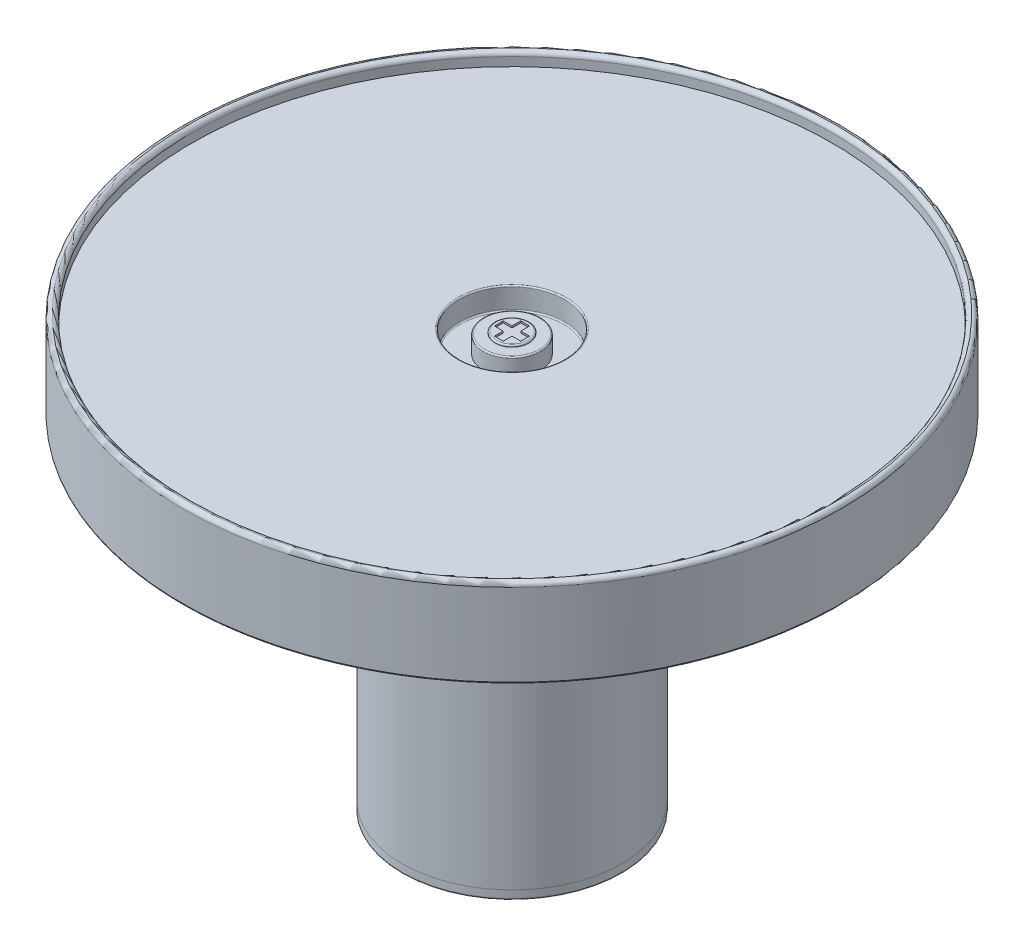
ISO-10303-21;
HEADER;
FILE_DESCRIPTION(('STEP AP214'),'2;1');
FILE_NAME('part.step','',(''),(''),'','','');
FILE_SCHEMA(('AUTOMOTIVE_DESIGN { 1 0 10303 214 1 1 1 1 }'));
ENDSEC;
DATA;
#1=APPLICATION_CONTEXT('core data for automotive mechanical design processes');
#2=APPLICATION_PROTOCOL_DEFINITION('international standard','automotive_design',2000,#1);
#3=PRODUCT_CONTEXT('',#1,'mechanical');
#4=PRODUCT('Part','Part','',(#3));
#5=PRODUCT_RELATED_PRODUCT_CATEGORY('part','',(#4));
#6=PRODUCT_DEFINITION_FORMATION('','',#4);
#7=PRODUCT_DEFINITION_CONTEXT('part definition',#1,'design');
#8=PRODUCT_DEFINITION('design','',#6,#7);
#9=PRODUCT_DEFINITION_SHAPE('','',#8);
#10=(LENGTH_UNIT() NAMED_UNIT(*) SI_UNIT(.MILLI.,.METRE.));
#11=(NAMED_UNIT(*) PLANE_ANGLE_UNIT() SI_UNIT($,.RADIAN.));
#12=(NAMED_UNIT(*) SI_UNIT($,.STERADIAN.) SOLID_ANGLE_UNIT());
#13=UNCERTAINTY_MEASURE_WITH_UNIT(LENGTH_MEASURE(1.E-05),#10,'distance_accuracy_value','');
#14=(GEOMETRIC_REPRESENTATION_CONTEXT(3) GLOBAL_UNCERTAINTY_ASSIGNED_CONTEXT((#13)) GLOBAL_UNIT_ASSIGNED_CONTEXT((#10,
#11,#12)) REPRESENTATION_CONTEXT('',''));
#15=CARTESIAN_POINT('',(0.,0.,0.));
#16=DIRECTION('',(0.,0.,1.));
#17=DIRECTION('',(1.,0.,0.));
#18=AXIS2_PLACEMENT_3D('',#15,#16,#17);
#19=CARTESIAN_POINT('',(0.,94.5,0.));
#20=DIRECTION('',(0.,1.,0.));
#21=DIRECTION('',(0.,0.,1.));
#22=AXIS2_PLACEMENT_3D('',#19,#20,#21);
#23=PLANE('',#22);
#24=CARTESIAN_POINT('',(0.,94.5,0.));
#25=DIRECTION('',(0.,1.,0.));
#26=DIRECTION('',(0.,0.,1.));
#27=AXIS2_PLACEMENT_3D('',#24,#25,#26);
#28=CIRCLE('',#27,3.57639320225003);
#29=CARTESIAN_POINT('',(0.,94.5,3.57639320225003));
#30=VERTEX_POINT('',#29);
#31=EDGE_CURVE('E12',#30,#30,#28,.T.);
#32=ORIENTED_EDGE('',*,*,#31,.T.);
#33=EDGE_LOOP('',(#32));
#34=FACE_BOUND('',#33,.T.);
#35=DIRECTION('',(0.,0.,1.));
#36=VECTOR('',#35,1.);
#37=CARTESIAN_POINT('',(-1.,94.5,-0.999999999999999));
#38=LINE('',#37,#36);
#39=CARTESIAN_POINT('',(-1.,94.5,-3.));
#40=VERTEX_POINT('',#39);
#41=CARTESIAN_POINT('',(-1.,94.5,-0.999999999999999));
#42=VERTEX_POINT('',#41);
#43=EDGE_CURVE('E65',#40,#42,#38,.T.);
#44=ORIENTED_EDGE('',*,*,#43,.F.);
#45=DIRECTION('',(-1.,0.,0.));
#46=VECTOR('',#45,1.);
#47=CARTESIAN_POINT('',(1.,94.5,-3.));
#48=LINE('',#47,#46);
#49=CARTESIAN_POINT('',(1.,94.5,-3.));
#50=VERTEX_POINT('',#49);
#51=EDGE_CURVE('E202',#50,#40,#48,.T.);
#52=ORIENTED_EDGE('',*,*,#51,.F.);
#53=DIRECTION('',(0.,0.,-1.));
#54=VECTOR('',#53,1.);
#55=CARTESIAN_POINT('',(1.,94.5,-0.999999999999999));
#56=LINE('',#55,#54);
#57=CARTESIAN_POINT('',(1.,94.5,-0.999999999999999));
#58=VERTEX_POINT('',#57);
#59=EDGE_CURVE('E200',#58,#50,#56,.T.);
#60=ORIENTED_EDGE('',*,*,#59,.F.);
#61=DIRECTION('',(-1.,0.,0.));
#62=VECTOR('',#61,1.);
#63=CARTESIAN_POINT('',(1.,94.5,-0.999999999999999));
#64=LINE('',#63,#62);
#65=CARTESIAN_POINT('',(3.,94.5,-0.999999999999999));
#66=VERTEX_POINT('',#65);
#67=EDGE_CURVE('E149',#66,#58,#64,.T.);
#68=ORIENTED_EDGE('',*,*,#67,.F.);
#69=DIRECTION('',(0.,0.,-1.));
#70=VECTOR('',#69,1.);
#71=CARTESIAN_POINT('',(3.,94.5,1.));
#72=LINE('',#71,#70);
#73=CARTESIAN_POINT('',(3.,94.5,1.));
#74=VERTEX_POINT('',#73);
#75=EDGE_CURVE('E196',#74,#66,#72,.T.);
#76=ORIENTED_EDGE('',*,*,#75,.F.);
#77=DIRECTION('',(1.,0.,0.));
#78=VECTOR('',#77,1.);
#79=CARTESIAN_POINT('',(1.,94.5,1.));
#80=LINE('',#79,#78);
#81=CARTESIAN_POINT('',(1.,94.5,1.));
#82=VERTEX_POINT('',#81);
#83=EDGE_CURVE('E193',#82,#74,#80,.T.);
#84=ORIENTED_EDGE('',*,*,#83,.F.);
#85=DIRECTION('',(0.,0.,-1.));
#86=VECTOR('',#85,1.);
#87=CARTESIAN_POINT('',(1.,94.5,3.));
#88=LINE('',#87,#86);
#89=CARTESIAN_POINT('',(1.,94.5,3.));
#90=VERTEX_POINT('',#89);
#91=EDGE_CURVE('E190',#90,#82,#88,.T.);
#92=ORIENTED_EDGE('',*,*,#91,.F.);
#93=DIRECTION('',(1.,0.,0.));
#94=VECTOR('',#93,1.);
#95=CARTESIAN_POINT('',(1.,94.5,3.));
#96=LINE('',#95,#94);
#97=CARTESIAN_POINT('',(-1.,94.5,3.));
#98=VERTEX_POINT('',#97);
#99=EDGE_CURVE('E187',#98,#90,#96,.T.);
#100=ORIENTED_EDGE('',*,*,#99,.F.);
#101=DIRECTION('',(0.,0.,1.));
#102=VECTOR('',#101,1.);
#103=CARTESIAN_POINT('',(-1.,94.5,3.));
#104=LINE('',#103,#102);
#105=CARTESIAN_POINT('',(-0.999999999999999,94.5,1.));
#106=VERTEX_POINT('',#105);
#107=EDGE_CURVE('E184',#106,#98,#104,.T.);
#108=ORIENTED_EDGE('',*,*,#107,.F.);
#109=DIRECTION('',(1.,0.,0.));
#110=VECTOR('',#109,1.);
#111=CARTESIAN_POINT('',(-3.,94.5,1.));
#112=LINE('',#111,#110);
#113=CARTESIAN_POINT('',(-3.,94.5,1.));
#114=VERTEX_POINT('',#113);
#115=EDGE_CURVE('E181',#114,#106,#112,.T.);
#116=ORIENTED_EDGE('',*,*,#115,.F.);
#117=DIRECTION('',(0.,0.,1.));
#118=VECTOR('',#117,1.);
#119=CARTESIAN_POINT('',(-3.,94.5,1.));
#120=LINE('',#119,#118);
#121=CARTESIAN_POINT('',(-3.,94.5,-0.999999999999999));
#122=VERTEX_POINT('',#121);
#123=EDGE_CURVE('E178',#122,#114,#120,.T.);
#124=ORIENTED_EDGE('',*,*,#123,.F.);
#125=DIRECTION('',(-1.,0.,0.));
#126=VECTOR('',#125,1.);
#127=CARTESIAN_POINT('',(-3.,94.5,-0.999999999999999));
#128=LINE('',#127,#126);
#129=EDGE_CURVE('E175',#42,#122,#128,.T.);
#130=ORIENTED_EDGE('',*,*,#129,.F.);
#131=EDGE_LOOP('',(#44,#52,#60,#68,#76,#84,#92,#100,#108,#116,#124,#130));
#132=FACE_BOUND('',#131,.T.);
#133=ADVANCED_FACE('F50',(#34,#132),#23,.T.);
#134=CARTESIAN_POINT('',(0.,94.,0.));
#135=DIRECTION('',(0.,1.,0.));
#136=DIRECTION('',(0.,0.,1.));
#137=AXIS2_PLACEMENT_3D('',#134,#135,#136);
#138=PLANE('',#137);
#139=CARTESIAN_POINT('',(0.,94.,0.));
#140=DIRECTION('',(0.,1.,0.));
#141=DIRECTION('',(0.,0.,1.));
#142=AXIS2_PLACEMENT_3D('',#139,#140,#141);
#143=CIRCLE('',#142,3.8);
#144=CARTESIAN_POINT('',(0.,94.,3.8));
#145=VERTEX_POINT('',#144);
#146=EDGE_CURVE('E58',#145,#145,#143,.T.);
#147=ORIENTED_EDGE('',*,*,#146,.F.);
#148=EDGE_LOOP('',(#147));
#149=FACE_BOUND('',#148,.T.);
#150=ADVANCED_FACE('F227',(#149),#138,.F.);
#151=CARTESIAN_POINT('',(-1.,94.1,-0.999999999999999));
#152=DIRECTION('',(-1.,0.,0.));
#153=DIRECTION('',(0.,0.,1.));
#154=AXIS2_PLACEMENT_3D('',#151,#152,#153);
#155=PLANE('',#154);
#156=ORIENTED_EDGE('',*,*,#43,.T.);
#157=DIRECTION('',(0.,1.,0.));
#158=VECTOR('',#157,1.);
#159=CARTESIAN_POINT('',(-1.,94.1,-0.999999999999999));
#160=LINE('',#159,#158);
#161=CARTESIAN_POINT('',(-1.,94.1,-0.999999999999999));
#162=VERTEX_POINT('',#161);
#163=EDGE_CURVE('E113',#162,#42,#160,.T.);
#164=ORIENTED_EDGE('',*,*,#163,.F.);
#165=DIRECTION('',(0.,0.,1.));
#166=VECTOR('',#165,1.);
#167=CARTESIAN_POINT('',(-1.,94.1,-0.999999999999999));
#168=LINE('',#167,#166);
#169=CARTESIAN_POINT('',(-1.,94.1,-3.));
#170=VERTEX_POINT('',#169);
#171=EDGE_CURVE('E204',#170,#162,#168,.T.);
#172=ORIENTED_EDGE('',*,*,#171,.F.);
#173=DIRECTION('',(0.,1.,0.));
#174=VECTOR('',#173,1.);
#175=CARTESIAN_POINT('',(-1.,94.1,-3.));
#176=LINE('',#175,#174);
#177=EDGE_CURVE('E73',#170,#40,#176,.T.);
#178=ORIENTED_EDGE('',*,*,#177,.T.);
#179=EDGE_LOOP('',(#156,#164,#172,#178));
#180=FACE_BOUND('',#179,.T.);
#181=ADVANCED_FACE('F229',(#180),#155,.F.);
#182=CARTESIAN_POINT('',(1.,94.1,-3.));
#183=DIRECTION('',(0.,0.,-1.));
#184=DIRECTION('',(-1.,0.,0.));
#185=AXIS2_PLACEMENT_3D('',#182,#183,#184);
#186=PLANE('',#185);
#187=ORIENTED_EDGE('',*,*,#51,.T.);
#188=ORIENTED_EDGE('',*,*,#177,.F.);
#189=DIRECTION('',(-1.,0.,0.));
#190=VECTOR('',#189,1.);
#191=CARTESIAN_POINT('',(1.,94.1,-3.));
#192=LINE('',#191,#190);
#193=CARTESIAN_POINT('',(1.,94.1,-3.));
#194=VERTEX_POINT('',#193);
#195=EDGE_CURVE('E161',#194,#170,#192,.T.);
#196=ORIENTED_EDGE('',*,*,#195,.F.);
#197=DIRECTION('',(0.,1.,0.));
#198=VECTOR('',#197,1.);
#199=CARTESIAN_POINT('',(1.,94.1,-3.));
#200=LINE('',#199,#198);
#201=EDGE_CURVE('E153',#194,#50,#200,.T.);
#202=ORIENTED_EDGE('',*,*,#201,.T.);
#203=EDGE_LOOP('',(#187,#188,#196,#202));
#204=FACE_BOUND('',#203,.T.);
#205=ADVANCED_FACE('F234',(#204),#186,.F.);
#206=CARTESIAN_POINT('',(1.,94.1,-0.999999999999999));
#207=DIRECTION('',(1.,0.,0.));
#208=DIRECTION('',(0.,0.,-1.));
#209=AXIS2_PLACEMENT_3D('',#206,#207,#208);
#210=PLANE('',#209);
#211=ORIENTED_EDGE('',*,*,#59,.T.);
#212=ORIENTED_EDGE('',*,*,#201,.F.);
#213=DIRECTION('',(0.,0.,-1.));
#214=VECTOR('',#213,1.);
#215=CARTESIAN_POINT('',(1.,94.1,-0.999999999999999));
#216=LINE('',#215,#214);
#217=CARTESIAN_POINT('',(1.,94.1,-0.999999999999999));
#218=VERTEX_POINT('',#217);
#219=EDGE_CURVE('E157',#218,#194,#216,.T.);
#220=ORIENTED_EDGE('',*,*,#219,.F.);
#221=DIRECTION('',(0.,1.,0.));
#222=VECTOR('',#221,1.);
#223=CARTESIAN_POINT('',(1.,94.1,-0.999999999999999));
#224=LINE('',#223,#222);
#225=EDGE_CURVE('E142',#218,#58,#224,.T.);
#226=ORIENTED_EDGE('',*,*,#225,.T.);
#227=EDGE_LOOP('',(#211,#212,#220,#226));
#228=FACE_BOUND('',#227,.T.);
#229=ADVANCED_FACE('F158',(#228),#210,.F.);
#230=CARTESIAN_POINT('',(1.,94.1,-0.999999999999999));
#231=DIRECTION('',(0.,0.,-1.));
#232=DIRECTION('',(-1.,0.,0.));
#233=AXIS2_PLACEMENT_3D('',#230,#231,#232);
#234=PLANE('',#233);
#235=ORIENTED_EDGE('',*,*,#67,.T.);
#236=ORIENTED_EDGE('',*,*,#225,.F.);
#237=DIRECTION('',(-1.,0.,0.));
#238=VECTOR('',#237,1.);
#239=CARTESIAN_POINT('',(1.,94.1,-0.999999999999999));
#240=LINE('',#239,#238);
#241=CARTESIAN_POINT('',(3.,94.1,-0.999999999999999));
#242=VERTEX_POINT('',#241);
#243=EDGE_CURVE('E146',#242,#218,#240,.T.);
#244=ORIENTED_EDGE('',*,*,#243,.F.);
#245=DIRECTION('',(0.,1.,0.));
#246=VECTOR('',#245,1.);
#247=CARTESIAN_POINT('',(3.,94.1,-0.999999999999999));
#248=LINE('',#247,#246);
#249=EDGE_CURVE('E154',#242,#66,#248,.T.);
#250=ORIENTED_EDGE('',*,*,#249,.T.);
#251=EDGE_LOOP('',(#235,#236,#244,#250));
#252=FACE_BOUND('',#251,.T.);
#253=ADVANCED_FACE('F144',(#252),#234,.F.);
#254=CARTESIAN_POINT('',(3.,94.1,1.));
#255=DIRECTION('',(1.,0.,0.));
#256=DIRECTION('',(0.,0.,-1.));
#257=AXIS2_PLACEMENT_3D('',#254,#255,#256);
#258=PLANE('',#257);
#259=ORIENTED_EDGE('',*,*,#75,.T.);
#260=ORIENTED_EDGE('',*,*,#249,.F.);
#261=DIRECTION('',(0.,0.,-1.));
#262=VECTOR('',#261,1.);
#263=CARTESIAN_POINT('',(3.,94.1,1.));
#264=LINE('',#263,#262);
#265=CARTESIAN_POINT('',(3.,94.1,1.));
#266=VERTEX_POINT('',#265);
#267=EDGE_CURVE('E167',#266,#242,#264,.T.);
#268=ORIENTED_EDGE('',*,*,#267,.F.);
#269=DIRECTION('',(0.,1.,0.));
#270=VECTOR('',#269,1.);
#271=CARTESIAN_POINT('',(3.,94.1,1.));
#272=LINE('',#271,#270);
#273=EDGE_CURVE('E208',#266,#74,#272,.T.);
#274=ORIENTED_EDGE('',*,*,#273,.T.);
#275=EDGE_LOOP('',(#259,#260,#268,#274));
#276=FACE_BOUND('',#275,.T.);
#277=ADVANCED_FACE('F266',(#276),#258,.F.);
#278=CARTESIAN_POINT('',(1.,94.1,1.));
#279=DIRECTION('',(0.,0.,1.));
#280=DIRECTION('',(1.,0.,0.));
#281=AXIS2_PLACEMENT_3D('',#278,#279,#280);
#282=PLANE('',#281);
#283=ORIENTED_EDGE('',*,*,#83,.T.);
#284=ORIENTED_EDGE('',*,*,#273,.F.);
#285=DIRECTION('',(1.,0.,0.));
#286=VECTOR('',#285,1.);
#287=CARTESIAN_POINT('',(1.,94.1,1.));
#288=LINE('',#287,#286);
#289=CARTESIAN_POINT('',(1.,94.1,1.));
#290=VERTEX_POINT('',#289);
#291=EDGE_CURVE('E169',#290,#266,#288,.T.);
#292=ORIENTED_EDGE('',*,*,#291,.F.);
#293=DIRECTION('',(0.,1.,0.));
#294=VECTOR('',#293,1.);
#295=CARTESIAN_POINT('',(1.,94.1,1.));
#296=LINE('',#295,#294);
#297=EDGE_CURVE('E210',#290,#82,#296,.T.);
#298=ORIENTED_EDGE('',*,*,#297,.T.);
#299=EDGE_LOOP('',(#283,#284,#292,#298));
#300=FACE_BOUND('',#299,.T.);
#301=ADVANCED_FACE('F262',(#300),#282,.F.);
#302=CARTESIAN_POINT('',(1.,94.1,3.));
#303=DIRECTION('',(1.,0.,0.));
#304=DIRECTION('',(0.,0.,-1.));
#305=AXIS2_PLACEMENT_3D('',#302,#303,#304);
#306=PLANE('',#305);
#307=ORIENTED_EDGE('',*,*,#91,.T.);
#308=ORIENTED_EDGE('',*,*,#297,.F.);
#309=DIRECTION('',(0.,0.,-1.));
#310=VECTOR('',#309,1.);
#311=CARTESIAN_POINT('',(1.,94.1,3.));
#312=LINE('',#311,#310);
#313=CARTESIAN_POINT('',(1.,94.1,3.));
#314=VERTEX_POINT('',#313);
#315=EDGE_CURVE('E396',#314,#290,#312,.T.);
#316=ORIENTED_EDGE('',*,*,#315,.F.);
#317=DIRECTION('',(0.,1.,0.));
#318=VECTOR('',#317,1.);
#319=CARTESIAN_POINT('',(1.,94.1,3.));
#320=LINE('',#319,#318);
#321=EDGE_CURVE('E212',#314,#90,#320,.T.);
#322=ORIENTED_EDGE('',*,*,#321,.T.);
#323=EDGE_LOOP('',(#307,#308,#316,#322));
#324=FACE_BOUND('',#323,.T.);
#325=ADVANCED_FACE('F258',(#324),#306,.F.);
#326=CARTESIAN_POINT('',(1.,94.1,3.));
#327=DIRECTION('',(0.,0.,1.));
#328=DIRECTION('',(1.,0.,0.));
#329=AXIS2_PLACEMENT_3D('',#326,#327,#328);
#330=PLANE('',#329);
#331=ORIENTED_EDGE('',*,*,#99,.T.);
#332=ORIENTED_EDGE('',*,*,#321,.F.);
#333=DIRECTION('',(1.,0.,0.));
#334=VECTOR('',#333,1.);
#335=CARTESIAN_POINT('',(1.,94.1,3.));
#336=LINE('',#335,#334);
#337=CARTESIAN_POINT('',(-1.,94.1,3.));
#338=VERTEX_POINT('',#337);
#339=EDGE_CURVE('E393',#338,#314,#336,.T.);
#340=ORIENTED_EDGE('',*,*,#339,.F.);
#341=DIRECTION('',(0.,1.,0.));
#342=VECTOR('',#341,1.);
#343=CARTESIAN_POINT('',(-1.,94.1,3.));
#344=LINE('',#343,#342);
#345=EDGE_CURVE('E214',#338,#98,#344,.T.);
#346=ORIENTED_EDGE('',*,*,#345,.T.);
#347=EDGE_LOOP('',(#331,#332,#340,#346));
#348=FACE_BOUND('',#347,.T.);
#349=ADVANCED_FACE('F254',(#348),#330,.F.);
#350=CARTESIAN_POINT('',(-1.,94.1,3.));
#351=DIRECTION('',(-1.,0.,0.));
#352=DIRECTION('',(0.,0.,1.));
#353=AXIS2_PLACEMENT_3D('',#350,#351,#352);
#354=PLANE('',#353);
#355=ORIENTED_EDGE('',*,*,#107,.T.);
#356=ORIENTED_EDGE('',*,*,#345,.F.);
#357=DIRECTION('',(0.,0.,1.));
#358=VECTOR('',#357,1.);
#359=CARTESIAN_POINT('',(-1.,94.1,3.));
#360=LINE('',#359,#358);
#361=CARTESIAN_POINT('',(-0.999999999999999,94.1,1.));
#362=VERTEX_POINT('',#361);
#363=EDGE_CURVE('E390',#362,#338,#360,.T.);
#364=ORIENTED_EDGE('',*,*,#363,.F.);
#365=DIRECTION('',(0.,1.,0.));
#366=VECTOR('',#365,1.);
#367=CARTESIAN_POINT('',(-0.999999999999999,94.1,1.));
#368=LINE('',#367,#366);
#369=EDGE_CURVE('E216',#362,#106,#368,.T.);
#370=ORIENTED_EDGE('',*,*,#369,.T.);
#371=EDGE_LOOP('',(#355,#356,#364,#370));
#372=FACE_BOUND('',#371,.T.);
#373=ADVANCED_FACE('F250',(#372),#354,.F.);
#374=CARTESIAN_POINT('',(-3.,94.1,1.));
#375=DIRECTION('',(0.,0.,1.));
#376=DIRECTION('',(1.,0.,0.));
#377=AXIS2_PLACEMENT_3D('',#374,#375,#376);
#378=PLANE('',#377);
#379=ORIENTED_EDGE('',*,*,#115,.T.);
#380=ORIENTED_EDGE('',*,*,#369,.F.);
#381=DIRECTION('',(1.,0.,0.));
#382=VECTOR('',#381,1.);
#383=CARTESIAN_POINT('',(-3.,94.1,1.));
#384=LINE('',#383,#382);
#385=CARTESIAN_POINT('',(-3.,94.1,1.));
#386=VERTEX_POINT('',#385);
#387=EDGE_CURVE('E387',#386,#362,#384,.T.);
#388=ORIENTED_EDGE('',*,*,#387,.F.);
#389=DIRECTION('',(0.,1.,0.));
#390=VECTOR('',#389,1.);
#391=CARTESIAN_POINT('',(-3.,94.1,1.));
#392=LINE('',#391,#390);
#393=EDGE_CURVE('E218',#386,#114,#392,.T.);
#394=ORIENTED_EDGE('',*,*,#393,.T.);
#395=EDGE_LOOP('',(#379,#380,#388,#394));
#396=FACE_BOUND('',#395,.T.);
#397=ADVANCED_FACE('F246',(#396),#378,.F.);
#398=CARTESIAN_POINT('',(-3.,94.1,1.));
#399=DIRECTION('',(-1.,0.,0.));
#400=DIRECTION('',(0.,0.,1.));
#401=AXIS2_PLACEMENT_3D('',#398,#399,#400);
#402=PLANE('',#401);
#403=ORIENTED_EDGE('',*,*,#123,.T.);
#404=ORIENTED_EDGE('',*,*,#393,.F.);
#405=DIRECTION('',(0.,0.,1.));
#406=VECTOR('',#405,1.);
#407=CARTESIAN_POINT('',(-3.,94.1,1.));
#408=LINE('',#407,#406);
#409=CARTESIAN_POINT('',(-3.,94.1,-0.999999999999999));
#410=VERTEX_POINT('',#409);
#411=EDGE_CURVE('E382',#410,#386,#408,.T.);
#412=ORIENTED_EDGE('',*,*,#411,.F.);
#413=DIRECTION('',(0.,1.,0.));
#414=VECTOR('',#413,1.);
#415=CARTESIAN_POINT('',(-3.,94.1,-0.999999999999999));
#416=LINE('',#415,#414);
#417=EDGE_CURVE('E220',#410,#122,#416,.T.);
#418=ORIENTED_EDGE('',*,*,#417,.T.);
#419=EDGE_LOOP('',(#403,#404,#412,#418));
#420=FACE_BOUND('',#419,.T.);
#421=ADVANCED_FACE('F242',(#420),#402,.F.);
#422=CARTESIAN_POINT('',(-3.,94.1,-0.999999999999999));
#423=DIRECTION('',(0.,0.,-1.));
#424=DIRECTION('',(-1.,0.,0.));
#425=AXIS2_PLACEMENT_3D('',#422,#423,#424);
#426=PLANE('',#425);
#427=ORIENTED_EDGE('',*,*,#129,.T.);
#428=ORIENTED_EDGE('',*,*,#417,.F.);
#429=DIRECTION('',(-1.,0.,0.));
#430=VECTOR('',#429,1.);
#431=CARTESIAN_POINT('',(-3.,94.1,-0.999999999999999));
#432=LINE('',#431,#430);
#433=EDGE_CURVE('E380',#162,#410,#432,.T.);
#434=ORIENTED_EDGE('',*,*,#433,.F.);
#435=ORIENTED_EDGE('',*,*,#163,.T.);
#436=EDGE_LOOP('',(#427,#428,#434,#435));
#437=FACE_BOUND('',#436,.T.);
#438=ADVANCED_FACE('F239',(#437),#426,.F.);
#439=CARTESIAN_POINT('',(0.,94.1,0.));
#440=DIRECTION('',(0.,1.,0.));
#441=DIRECTION('',(0.,0.,1.));
#442=AXIS2_PLACEMENT_3D('',#439,#440,#441);
#443=PLANE('',#442);
#444=ORIENTED_EDGE('',*,*,#171,.T.);
#445=ORIENTED_EDGE('',*,*,#433,.T.);
#446=ORIENTED_EDGE('',*,*,#411,.T.);
#447=ORIENTED_EDGE('',*,*,#387,.T.);
#448=ORIENTED_EDGE('',*,*,#363,.T.);
#449=ORIENTED_EDGE('',*,*,#339,.T.);
#450=ORIENTED_EDGE('',*,*,#315,.T.);
#451=ORIENTED_EDGE('',*,*,#291,.T.);
#452=ORIENTED_EDGE('',*,*,#267,.T.);
#453=ORIENTED_EDGE('',*,*,#243,.T.);
#454=ORIENTED_EDGE('',*,*,#219,.T.);
#455=ORIENTED_EDGE('',*,*,#195,.T.);
#456=EDGE_LOOP('',(#444,#445,#446,#447,#448,#449,#450,#451,#452,#453,#454,#455));
#457=FACE_BOUND('',#456,.T.);
#458=ADVANCED_FACE('F164',(#457),#443,.T.);
#459=CARTESIAN_POINT('',(0.,94.2,0.));
#460=DIRECTION('',(0.,-1.,0.));
#461=DIRECTION('',(0.,0.,-1.));
#462=AXIS2_PLACEMENT_3D('',#459,#460,#461);
#463=TOROIDAL_SURFACE('',#462,3.57639320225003,0.3);
#464=ORIENTED_EDGE('',*,*,#146,.T.);
#465=EDGE_LOOP('',(#464));
#466=FACE_BOUND('',#465,.T.);
#467=ORIENTED_EDGE('',*,*,#31,.F.);
#468=EDGE_LOOP('',(#467));
#469=FACE_BOUND('',#468,.T.);
#470=ADVANCED_FACE('F52',(#466,#469),#463,.T.);
#471=CLOSED_SHELL('',(#133,#150,#181,#205,#229,#253,#277,#301,#325,#349,#373,#397,#421,#438,
#458,#470));
#472=MANIFOLD_SOLID_BREP('B2',#471);
#473=CARTESIAN_POINT('',(0.,79.,0.));
#474=DIRECTION('',(0.,-1.,0.));
#475=DIRECTION('',(0.,0.,-1.));
#476=AXIS2_PLACEMENT_3D('',#473,#474,#475);
#477=CYLINDRICAL_SURFACE('',#476,75.);
#478=CARTESIAN_POINT('',(0.,78.3,0.));
#479=DIRECTION('',(0.,-1.,0.));
#480=DIRECTION('',(0.,0.,-1.));
#481=AXIS2_PLACEMENT_3D('',#478,#479,#480);
#482=CIRCLE('',#481,75.);
#483=CARTESIAN_POINT('',(0.,78.3,-75.));
#484=VERTEX_POINT('',#483);
#485=EDGE_CURVE('E442',#484,#484,#482,.F.);
#486=ORIENTED_EDGE('',*,*,#485,.T.);
#487=EDGE_LOOP('',(#486));
#488=FACE_BOUND('',#487,.T.);
#489=CARTESIAN_POINT('',(0.,97.,0.));
#490=DIRECTION('',(0.,1.,0.));
#491=DIRECTION('',(0.,0.,1.));
#492=AXIS2_PLACEMENT_3D('',#489,#490,#491);
#493=CIRCLE('',#492,75.);
#494=CARTESIAN_POINT('',(0.,97.,75.));
#495=VERTEX_POINT('',#494);
#496=EDGE_CURVE('E456',#495,#495,#493,.F.);
#497=ORIENTED_EDGE('',*,*,#496,.T.);
#498=EDGE_LOOP('',(#497));
#499=FACE_BOUND('',#498,.T.);
#500=ADVANCED_FACE('F419',(#488,#499),#477,.T.);
#501=CARTESIAN_POINT('',(0.,78.,0.));
#502=DIRECTION('',(0.,-1.,0.));
#503=DIRECTION('',(0.,0.,-1.));
#504=AXIS2_PLACEMENT_3D('',#501,#502,#503);
#505=PLANE('',#504);
#506=CARTESIAN_POINT('',(0.,78.,0.));
#507=DIRECTION('',(0.,-1.,0.));
#508=DIRECTION('',(0.,0.,-1.));
#509=AXIS2_PLACEMENT_3D('',#506,#507,#508);
#510=CIRCLE('',#509,74.7);
#511=CARTESIAN_POINT('',(0.,78.,-74.7));
#512=VERTEX_POINT('',#511);
#513=EDGE_CURVE('E445',#512,#512,#510,.T.);
#514=ORIENTED_EDGE('',*,*,#513,.T.);
#515=EDGE_LOOP('',(#514));
#516=FACE_BOUND('',#515,.T.);
#517=CARTESIAN_POINT('',(0.,78.,0.));
#518=DIRECTION('',(0.,-1.,0.));
#519=DIRECTION('',(0.,0.,-1.));
#520=AXIS2_PLACEMENT_3D('',#517,#518,#519);
#521=CIRCLE('',#520,71.);
#522=CARTESIAN_POINT('',(0.,78.,-71.));
#523=VERTEX_POINT('',#522);
#524=EDGE_CURVE('E460',#523,#523,#521,.T.);
#525=ORIENTED_EDGE('',*,*,#524,.F.);
#526=EDGE_LOOP('',(#525));
#527=FACE_BOUND('',#526,.T.);
#528=ADVANCED_FACE('F503',(#516,#527),#505,.T.);
#529=CARTESIAN_POINT('',(0.,79.,0.));
#530=DIRECTION('',(0.,-1.,0.));
#531=DIRECTION('',(0.,0.,-1.));
#532=AXIS2_PLACEMENT_3D('',#529,#530,#531);
#533=CYLINDRICAL_SURFACE('',#532,71.);
#534=CARTESIAN_POINT('',(0.,79.,0.));
#535=DIRECTION('',(0.,-1.,0.));
#536=DIRECTION('',(0.,0.,-1.));
#537=AXIS2_PLACEMENT_3D('',#534,#535,#536);
#538=CIRCLE('',#537,71.);
#539=CARTESIAN_POINT('',(0.,79.,-71.));
#540=VERTEX_POINT('',#539);
#541=EDGE_CURVE('E459',#540,#540,#538,.T.);
#542=ORIENTED_EDGE('',*,*,#541,.F.);
#543=EDGE_LOOP('',(#542));
#544=FACE_BOUND('',#543,.T.);
#545=ORIENTED_EDGE('',*,*,#524,.T.);
#546=EDGE_LOOP('',(#545));
#547=FACE_BOUND('',#546,.T.);
#548=ADVANCED_FACE('F509',(#544,#547),#533,.F.);
#549=CARTESIAN_POINT('',(0.,79.,0.));
#550=DIRECTION('',(0.,1.,0.));
#551=DIRECTION('',(0.,0.,1.));
#552=AXIS2_PLACEMENT_3D('',#549,#550,#551);
#553=PLANE('',#552);
#554=ORIENTED_EDGE('',*,*,#541,.T.);
#555=EDGE_LOOP('',(#554));
#556=FACE_BOUND('',#555,.T.);
#557=ADVANCED_FACE('F538',(#556),#553,.F.);
#558=CARTESIAN_POINT('',(0.,95.,0.));
#559=DIRECTION('',(0.,1.,0.));
#560=DIRECTION('',(0.,0.,1.));
#561=AXIS2_PLACEMENT_3D('',#558,#559,#560);
#562=CYLINDRICAL_SURFACE('',#561,73.);
#563=CARTESIAN_POINT('',(0.,97.,0.));
#564=DIRECTION('',(0.,1.,0.));
#565=DIRECTION('',(0.,0.,1.));
#566=AXIS2_PLACEMENT_3D('',#563,#564,#565);
#567=CIRCLE('',#566,73.);
#568=CARTESIAN_POINT('',(0.,97.,73.));
#569=VERTEX_POINT('',#568);
#570=EDGE_CURVE('E448',#569,#569,#567,.T.);
#571=ORIENTED_EDGE('',*,*,#570,.T.);
#572=EDGE_LOOP('',(#571));
#573=FACE_BOUND('',#572,.T.);
#574=CARTESIAN_POINT('',(0.,95.,0.));
#575=DIRECTION('',(0.,1.,0.));
#576=DIRECTION('',(0.,0.,1.));
#577=AXIS2_PLACEMENT_3D('',#574,#575,#576);
#578=CIRCLE('',#577,73.);
#579=CARTESIAN_POINT('',(0.,95.,73.));
#580=VERTEX_POINT('',#579);
#581=EDGE_CURVE('E452',#580,#580,#578,.T.);
#582=ORIENTED_EDGE('',*,*,#581,.F.);
#583=EDGE_LOOP('',(#582));
#584=FACE_BOUND('',#583,.T.);
#585=ADVANCED_FACE('F543',(#573,#584),#562,.F.);
#586=CARTESIAN_POINT('',(0.,95.,0.));
#587=DIRECTION('',(0.,1.,0.));
#588=DIRECTION('',(0.,0.,1.));
#589=AXIS2_PLACEMENT_3D('',#586,#587,#588);
#590=PLANE('',#589);
#591=CARTESIAN_POINT('',(0.,95.,0.));
#592=DIRECTION('',(0.,1.,0.));
#593=DIRECTION('',(0.,0.,1.));
#594=AXIS2_PLACEMENT_3D('',#591,#592,#593);
#595=CIRCLE('',#594,12.3);
#596=CARTESIAN_POINT('',(0.,95.,12.3));
#597=VERTEX_POINT('',#596);
#598=EDGE_CURVE('E426',#597,#597,#595,.F.);
#599=ORIENTED_EDGE('',*,*,#598,.T.);
#600=EDGE_LOOP('',(#599));
#601=FACE_BOUND('',#600,.T.);
#602=ORIENTED_EDGE('',*,*,#581,.T.);
#603=EDGE_LOOP('',(#602));
#604=FACE_BOUND('',#603,.T.);
#605=ADVANCED_FACE('F522',(#601,#604),#590,.T.);
#606=CARTESIAN_POINT('',(0.,97.,0.));
#607=DIRECTION('',(0.,1.,0.));
#608=DIRECTION('',(0.,0.,1.));
#609=AXIS2_PLACEMENT_3D('',#606,#607,#608);
#610=TOROIDAL_SURFACE('',#609,74.,1.);
#611=ORIENTED_EDGE('',*,*,#570,.F.);
#612=EDGE_LOOP('',(#611));
#613=FACE_BOUND('',#612,.T.);
#614=CARTESIAN_POINT('',(0.,98.,0.));
#615=DIRECTION('',(0.,1.,0.));
#616=DIRECTION('',(0.,0.,1.));
#617=AXIS2_PLACEMENT_3D('',#614,#615,#616);
#618=CIRCLE('',#617,74.);
#619=CARTESIAN_POINT('',(0.,98.,74.));
#620=VERTEX_POINT('',#619);
#621=EDGE_CURVE('E449',#620,#620,#618,.F.);
#622=ORIENTED_EDGE('',*,*,#621,.F.);
#623=EDGE_LOOP('',(#622));
#624=FACE_BOUND('',#623,.T.);
#625=ADVANCED_FACE('F519',(#613,#624),#610,.T.);
#626=CARTESIAN_POINT('',(0.,97.,0.));
#627=DIRECTION('',(0.,1.,0.));
#628=DIRECTION('',(0.,0.,1.));
#629=AXIS2_PLACEMENT_3D('',#626,#627,#628);
#630=TOROIDAL_SURFACE('',#629,74.,1.);
#631=ORIENTED_EDGE('',*,*,#496,.F.);
#632=EDGE_LOOP('',(#631));
#633=FACE_BOUND('',#632,.T.);
#634=ORIENTED_EDGE('',*,*,#621,.T.);
#635=EDGE_LOOP('',(#634));
#636=FACE_BOUND('',#635,.T.);
#637=ADVANCED_FACE('F515',(#633,#636),#630,.T.);
#638=CARTESIAN_POINT('',(0.,78.3,0.));
#639=DIRECTION('',(0.,-1.,0.));
#640=DIRECTION('',(0.,0.,-1.));
#641=AXIS2_PLACEMENT_3D('',#638,#639,#640);
#642=TOROIDAL_SURFACE('',#641,74.7,0.3);
#643=ORIENTED_EDGE('',*,*,#485,.F.);
#644=EDGE_LOOP('',(#643));
#645=FACE_BOUND('',#644,.T.);
#646=ORIENTED_EDGE('',*,*,#513,.F.);
#647=EDGE_LOOP('',(#646));
#648=FACE_BOUND('',#647,.T.);
#649=ADVANCED_FACE('F518',(#645,#648),#642,.T.);
#650=CARTESIAN_POINT('',(0.,90.,0.));
#651=DIRECTION('',(0.,1.,0.));
#652=DIRECTION('',(0.,0.,1.));
#653=AXIS2_PLACEMENT_3D('',#650,#651,#652);
#654=CYLINDRICAL_SURFACE('',#653,12.);
#655=CARTESIAN_POINT('',(0.,90.3,0.));
#656=DIRECTION('',(0.,1.,0.));
#657=DIRECTION('',(0.,0.,1.));
#658=AXIS2_PLACEMENT_3D('',#655,#656,#657);
#659=CIRCLE('',#658,12.);
#660=CARTESIAN_POINT('',(0.,90.3,12.));
#661=VERTEX_POINT('',#660);
#662=EDGE_CURVE('E430',#661,#661,#659,.F.);
#663=ORIENTED_EDGE('',*,*,#662,.T.);
#664=EDGE_LOOP('',(#663));
#665=FACE_BOUND('',#664,.T.);
#666=CARTESIAN_POINT('',(0.,94.7,0.));
#667=DIRECTION('',(0.,1.,0.));
#668=DIRECTION('',(0.,0.,1.));
#669=AXIS2_PLACEMENT_3D('',#666,#667,#668);
#670=CIRCLE('',#669,12.);
#671=CARTESIAN_POINT('',(0.,94.7,12.));
#672=VERTEX_POINT('',#671);
#673=EDGE_CURVE('E434',#672,#672,#670,.T.);
#674=ORIENTED_EDGE('',*,*,#673,.T.);
#675=EDGE_LOOP('',(#674));
#676=FACE_BOUND('',#675,.T.);
#677=ADVANCED_FACE('F488',(#665,#676),#654,.F.);
#678=CARTESIAN_POINT('',(0.,90.,0.));
#679=DIRECTION('',(0.,1.,0.));
#680=DIRECTION('',(0.,0.,1.));
#681=AXIS2_PLACEMENT_3D('',#678,#679,#680);
#682=PLANE('',#681);
#683=CARTESIAN_POINT('',(0.,90.,0.));
#684=DIRECTION('',(0.,1.,0.));
#685=DIRECTION('',(0.,0.,1.));
#686=AXIS2_PLACEMENT_3D('',#683,#684,#685);
#687=CIRCLE('',#686,6.5);
#688=CARTESIAN_POINT('',(0.,90.,6.5));
#689=VERTEX_POINT('',#688);
#690=EDGE_CURVE('E478',#689,#689,#687,.T.);
#691=ORIENTED_EDGE('',*,*,#690,.F.);
#692=EDGE_LOOP('',(#691));
#693=FACE_BOUND('',#692,.T.);
#694=CARTESIAN_POINT('',(0.,90.,0.));
#695=DIRECTION('',(0.,1.,0.));
#696=DIRECTION('',(0.,0.,1.));
#697=AXIS2_PLACEMENT_3D('',#694,#695,#696);
#698=CIRCLE('',#697,11.7);
#699=CARTESIAN_POINT('',(0.,90.,11.7));
#700=VERTEX_POINT('',#699);
#701=EDGE_CURVE('E439',#700,#700,#698,.T.);
#702=ORIENTED_EDGE('',*,*,#701,.T.);
#703=EDGE_LOOP('',(#702));
#704=FACE_BOUND('',#703,.T.);
#705=ADVANCED_FACE('F484',(#693,#704),#682,.T.);
#706=CARTESIAN_POINT('',(0.,90.3,0.));
#707=DIRECTION('',(0.,1.,0.));
#708=DIRECTION('',(0.,0.,1.));
#709=AXIS2_PLACEMENT_3D('',#706,#707,#708);
#710=TOROIDAL_SURFACE('',#709,11.7,0.3);
#711=ORIENTED_EDGE('',*,*,#662,.F.);
#712=EDGE_LOOP('',(#711));
#713=FACE_BOUND('',#712,.T.);
#714=ORIENTED_EDGE('',*,*,#701,.F.);
#715=EDGE_LOOP('',(#714));
#716=FACE_BOUND('',#715,.T.);
#717=ADVANCED_FACE('F487',(#713,#716),#710,.F.);
#718=CARTESIAN_POINT('',(0.,94.7,0.));
#719=DIRECTION('',(0.,1.,0.));
#720=DIRECTION('',(0.,0.,1.));
#721=AXIS2_PLACEMENT_3D('',#718,#719,#720);
#722=TOROIDAL_SURFACE('',#721,12.3,0.3);
#723=ORIENTED_EDGE('',*,*,#598,.F.);
#724=EDGE_LOOP('',(#723));
#725=FACE_BOUND('',#724,.T.);
#726=ORIENTED_EDGE('',*,*,#673,.F.);
#727=EDGE_LOOP('',(#726));
#728=FACE_BOUND('',#727,.T.);
#729=ADVANCED_FACE('F421',(#725,#728),#722,.T.);
#730=CARTESIAN_POINT('',(0.,94.,0.));
#731=DIRECTION('',(0.,1.,0.));
#732=DIRECTION('',(0.,0.,1.));
#733=AXIS2_PLACEMENT_3D('',#730,#731,#732);
#734=PLANE('',#733);
#735=CARTESIAN_POINT('',(0.,94.,0.));
#736=DIRECTION('',(0.,1.,0.));
#737=DIRECTION('',(0.,0.,1.));
#738=AXIS2_PLACEMENT_3D('',#735,#736,#737);
#739=CIRCLE('',#738,6.2);
#740=CARTESIAN_POINT('',(0.,94.,6.2));
#741=VERTEX_POINT('',#740);
#742=EDGE_CURVE('E472',#741,#741,#739,.T.);
#743=ORIENTED_EDGE('',*,*,#742,.T.);
#744=EDGE_LOOP('',(#743));
#745=FACE_BOUND('',#744,.T.);
#746=CARTESIAN_POINT('',(0.,94.,0.));
#747=DIRECTION('',(0.,1.,0.));
#748=DIRECTION('',(0.,0.,1.));
#749=AXIS2_PLACEMENT_3D('',#746,#747,#748);
#750=CIRCLE('',#749,3.8);
#751=CARTESIAN_POINT('',(0.,94.,3.8));
#752=VERTEX_POINT('',#751);
#753=EDGE_CURVE('E475',#752,#752,#750,.F.);
#754=ORIENTED_EDGE('',*,*,#753,.T.);
#755=EDGE_LOOP('',(#754));
#756=FACE_BOUND('',#755,.T.);
#757=ADVANCED_FACE('F498',(#745,#756),#734,.T.);
#758=CARTESIAN_POINT('',(0.,94.,0.));
#759=DIRECTION('',(0.,-1.,0.));
#760=DIRECTION('',(0.,0.,-1.));
#761=AXIS2_PLACEMENT_3D('',#758,#759,#760);
#762=CYLINDRICAL_SURFACE('',#761,6.5);
#763=CARTESIAN_POINT('',(0.,93.7,0.));
#764=DIRECTION('',(0.,1.,0.));
#765=DIRECTION('',(0.,0.,1.));
#766=AXIS2_PLACEMENT_3D('',#763,#764,#765);
#767=CIRCLE('',#766,6.5);
#768=CARTESIAN_POINT('',(0.,93.7,6.5));
#769=VERTEX_POINT('',#768);
#770=EDGE_CURVE('E469',#769,#769,#767,.F.);
#771=ORIENTED_EDGE('',*,*,#770,.T.);
#772=EDGE_LOOP('',(#771));
#773=FACE_BOUND('',#772,.T.);
#774=ORIENTED_EDGE('',*,*,#690,.T.);
#775=EDGE_LOOP('',(#774));
#776=FACE_BOUND('',#775,.T.);
#777=ADVANCED_FACE('F482',(#773,#776),#762,.T.);
#778=CARTESIAN_POINT('',(0.,94.,0.));
#779=DIRECTION('',(0.,-1.,0.));
#780=DIRECTION('',(0.,0.,-1.));
#781=AXIS2_PLACEMENT_3D('',#778,#779,#780);
#782=CYLINDRICAL_SURFACE('',#781,3.5);
#783=CARTESIAN_POINT('',(0.,93.7,0.));
#784=DIRECTION('',(0.,1.,0.));
#785=DIRECTION('',(0.,0.,1.));
#786=AXIS2_PLACEMENT_3D('',#783,#784,#785);
#787=CIRCLE('',#786,3.5);
#788=CARTESIAN_POINT('',(0.,93.7,3.5));
#789=VERTEX_POINT('',#788);
#790=EDGE_CURVE('E453',#789,#789,#787,.T.);
#791=ORIENTED_EDGE('',*,*,#790,.T.);
#792=EDGE_LOOP('',(#791));
#793=FACE_BOUND('',#792,.T.);
#794=CARTESIAN_POINT('',(0.,90.,0.));
#795=DIRECTION('',(0.,1.,0.));
#796=DIRECTION('',(0.,0.,1.));
#797=AXIS2_PLACEMENT_3D('',#794,#795,#796);
#798=CIRCLE('',#797,3.5);
#799=CARTESIAN_POINT('',(0.,90.,3.5));
#800=VERTEX_POINT('',#799);
#801=EDGE_CURVE('E49',#800,#800,#798,.F.);
#802=ORIENTED_EDGE('',*,*,#801,.T.);
#803=EDGE_LOOP('',(#802));
#804=FACE_BOUND('',#803,.T.);
#805=ADVANCED_FACE('F560',(#793,#804),#782,.F.);
#806=CARTESIAN_POINT('',(0.,93.7,0.));
#807=DIRECTION('',(0.,1.,0.));
#808=DIRECTION('',(0.,0.,1.));
#809=AXIS2_PLACEMENT_3D('',#806,#807,#808);
#810=TOROIDAL_SURFACE('',#809,6.2,0.3);
#811=ORIENTED_EDGE('',*,*,#770,.F.);
#812=EDGE_LOOP('',(#811));
#813=FACE_BOUND('',#812,.T.);
#814=ORIENTED_EDGE('',*,*,#742,.F.);
#815=EDGE_LOOP('',(#814));
#816=FACE_BOUND('',#815,.T.);
#817=ADVANCED_FACE('F556',(#813,#816),#810,.T.);
#818=CARTESIAN_POINT('',(0.,93.7,0.));
#819=DIRECTION('',(0.,1.,0.));
#820=DIRECTION('',(0.,0.,1.));
#821=AXIS2_PLACEMENT_3D('',#818,#819,#820);
#822=TOROIDAL_SURFACE('',#821,3.8,0.3);
#823=ORIENTED_EDGE('',*,*,#753,.F.);
#824=EDGE_LOOP('',(#823));
#825=FACE_BOUND('',#824,.T.);
#826=ORIENTED_EDGE('',*,*,#790,.F.);
#827=EDGE_LOOP('',(#826));
#828=FACE_BOUND('',#827,.T.);
#829=ADVANCED_FACE('F553',(#825,#828),#822,.T.);
#830=ORIENTED_EDGE('',*,*,#801,.F.);
#831=EDGE_LOOP('',(#830));
#832=FACE_BOUND('',#831,.T.);
#833=ADVANCED_FACE('F490',(#832),#682,.T.);
#834=CLOSED_SHELL('',(#500,#528,#548,#557,#585,#605,#625,#637,#649,#677,#705,#717,#729,#757,
#777,#805,#817,#829,#833));
#835=MANIFOLD_SOLID_BREP('B6',#834);
#836=CARTESIAN_POINT('',(0.,79.,0.));
#837=DIRECTION('',(0.,-1.,0.));
#838=DIRECTION('',(0.,0.,-1.));
#839=AXIS2_PLACEMENT_3D('',#836,#837,#838);
#840=CYLINDRICAL_SURFACE('',#839,71.);
#841=CARTESIAN_POINT('',(0.,79.,0.));
#842=DIRECTION('',(0.,1.,0.));
#843=DIRECTION('',(0.,0.,1.));
#844=AXIS2_PLACEMENT_3D('',#841,#842,#843);
#845=CIRCLE('',#844,71.);
#846=CARTESIAN_POINT('',(0.,79.,71.));
#847=VERTEX_POINT('',#846);
#848=EDGE_CURVE('E418',#847,#847,#845,.T.);
#849=ORIENTED_EDGE('',*,*,#848,.F.);
#850=EDGE_LOOP('',(#849));
#851=FACE_BOUND('',#850,.T.);
#852=CARTESIAN_POINT('',(0.,78.,0.));
#853=DIRECTION('',(0.,1.,0.));
#854=DIRECTION('',(0.,0.,1.));
#855=AXIS2_PLACEMENT_3D('',#852,#853,#854);
#856=CIRCLE('',#855,71.);
#857=CARTESIAN_POINT('',(0.,78.,71.));
#858=VERTEX_POINT('',#857);
#859=EDGE_CURVE('E712',#858,#858,#856,.T.);
#860=ORIENTED_EDGE('',*,*,#859,.T.);
#861=EDGE_LOOP('',(#860));
#862=FACE_BOUND('',#861,.T.);
#863=ADVANCED_FACE('F709',(#851,#862),#840,.T.);
#864=CARTESIAN_POINT('',(0.,79.,0.));
#865=DIRECTION('',(0.,1.,0.));
#866=DIRECTION('',(0.,0.,1.));
#867=AXIS2_PLACEMENT_3D('',#864,#865,#866);
#868=PLANE('',#867);
#869=ORIENTED_EDGE('',*,*,#848,.T.);
#870=EDGE_LOOP('',(#869));
#871=FACE_BOUND('',#870,.T.);
#872=ADVANCED_FACE('F724',(#871),#868,.T.);
#873=CARTESIAN_POINT('',(0.,78.,0.));
#874=DIRECTION('',(0.,1.,0.));
#875=DIRECTION('',(0.,0.,1.));
#876=AXIS2_PLACEMENT_3D('',#873,#874,#875);
#877=PLANE('',#876);
#878=ORIENTED_EDGE('',*,*,#859,.F.);
#879=EDGE_LOOP('',(#878));
#880=FACE_BOUND('',#879,.T.);
#881=ADVANCED_FACE('F722',(#880),#877,.F.);
#882=CLOSED_SHELL('',(#863,#872,#881));
#883=MANIFOLD_SOLID_BREP('B44',#882);
#884=CARTESIAN_POINT('',(0.,78.,0.));
#885=DIRECTION('',(0.,1.,0.));
#886=DIRECTION('',(0.,0.,1.));
#887=AXIS2_PLACEMENT_3D('',#884,#885,#886);
#888=PLANE('',#887);
#889=CARTESIAN_POINT('',(0.,78.,0.));
#890=DIRECTION('',(0.,1.,0.));
#891=DIRECTION('',(0.,0.,1.));
#892=AXIS2_PLACEMENT_3D('',#889,#890,#891);
#893=CIRCLE('',#892,25.);
#894=CARTESIAN_POINT('',(0.,78.,25.));
#895=VERTEX_POINT('',#894);
#896=EDGE_CURVE('E708',#895,#895,#893,.T.);
#897=ORIENTED_EDGE('',*,*,#896,.T.);
#898=EDGE_LOOP('',(#897));
#899=FACE_BOUND('',#898,.T.);
#900=CARTESIAN_POINT('',(0.,78.,0.));
#901=DIRECTION('',(0.,1.,0.));
#902=DIRECTION('',(0.,0.,1.));
#903=AXIS2_PLACEMENT_3D('',#900,#901,#902);
#904=CIRCLE('',#903,23.);
#905=CARTESIAN_POINT('',(0.,78.,23.));
#906=VERTEX_POINT('',#905);
#907=EDGE_CURVE('E768',#906,#906,#904,.T.);
#908=ORIENTED_EDGE('',*,*,#907,.F.);
#909=EDGE_LOOP('',(#908));
#910=FACE_BOUND('',#909,.T.);
#911=ADVANCED_FACE('F757',(#899,#910),#888,.T.);
#912=CARTESIAN_POINT('',(0.,77.,0.));
#913=DIRECTION('',(0.,1.,0.));
#914=DIRECTION('',(0.,0.,1.));
#915=AXIS2_PLACEMENT_3D('',#912,#913,#914);
#916=PLANE('',#915);
#917=CARTESIAN_POINT('',(0.,77.,0.));
#918=DIRECTION('',(0.,1.,0.));
#919=DIRECTION('',(0.,0.,1.));
#920=AXIS2_PLACEMENT_3D('',#917,#918,#919);
#921=CIRCLE('',#920,25.);
#922=CARTESIAN_POINT('',(0.,77.,25.));
#923=VERTEX_POINT('',#922);
#924=EDGE_CURVE('E761',#923,#923,#921,.T.);
#925=ORIENTED_EDGE('',*,*,#924,.F.);
#926=EDGE_LOOP('',(#925));
#927=FACE_BOUND('',#926,.T.);
#928=CARTESIAN_POINT('',(0.,77.,0.));
#929=DIRECTION('',(0.,1.,0.));
#930=DIRECTION('',(0.,0.,1.));
#931=AXIS2_PLACEMENT_3D('',#928,#929,#930);
#932=CIRCLE('',#931,23.);
#933=CARTESIAN_POINT('',(0.,77.,23.));
#934=VERTEX_POINT('',#933);
#935=EDGE_CURVE('E770',#934,#934,#932,.T.);
#936=ORIENTED_EDGE('',*,*,#935,.T.);
#937=EDGE_LOOP('',(#936));
#938=FACE_BOUND('',#937,.T.);
#939=ADVANCED_FACE('F780',(#927,#938),#916,.F.);
#940=CARTESIAN_POINT('',(0.,78.,0.));
#941=DIRECTION('',(0.,-1.,0.));
#942=DIRECTION('',(0.,0.,-1.));
#943=AXIS2_PLACEMENT_3D('',#940,#941,#942);
#944=CYLINDRICAL_SURFACE('',#943,25.);
#945=ORIENTED_EDGE('',*,*,#896,.F.);
#946=EDGE_LOOP('',(#945));
#947=FACE_BOUND('',#946,.T.);
#948=ORIENTED_EDGE('',*,*,#924,.T.);
#949=EDGE_LOOP('',(#948));
#950=FACE_BOUND('',#949,.T.);
#951=ADVANCED_FACE('F759',(#947,#950),#944,.T.);
#952=CARTESIAN_POINT('',(0.,78.,0.));
#953=DIRECTION('',(0.,-1.,0.));
#954=DIRECTION('',(0.,0.,-1.));
#955=AXIS2_PLACEMENT_3D('',#952,#953,#954);
#956=CYLINDRICAL_SURFACE('',#955,23.);
#957=ORIENTED_EDGE('',*,*,#907,.T.);
#958=EDGE_LOOP('',(#957));
#959=FACE_BOUND('',#958,.T.);
#960=ORIENTED_EDGE('',*,*,#935,.F.);
#961=EDGE_LOOP('',(#960));
#962=FACE_BOUND('',#961,.T.);
#963=ADVANCED_FACE('F776',(#959,#962),#956,.F.);
#964=CLOSED_SHELL('',(#911,#939,#951,#963));
#965=MANIFOLD_SOLID_BREP('B413',#964);
#966=CARTESIAN_POINT('',(0.,77.,0.));
#967=DIRECTION('',(0.,1.,0.));
#968=DIRECTION('',(0.,0.,1.));
#969=AXIS2_PLACEMENT_3D('',#966,#967,#968);
#970=PLANE('',#969);
#971=CARTESIAN_POINT('',(0.,77.,0.));
#972=DIRECTION('',(0.,1.,0.));
#973=DIRECTION('',(0.,0.,1.));
#974=AXIS2_PLACEMENT_3D('',#971,#972,#973);
#975=CIRCLE('',#974,25.);
#976=CARTESIAN_POINT('',(0.,77.,25.));
#977=VERTEX_POINT('',#976);
#978=EDGE_CURVE('E756',#977,#977,#975,.T.);
#979=ORIENTED_EDGE('',*,*,#978,.T.);
#980=EDGE_LOOP('',(#979));
#981=FACE_BOUND('',#980,.T.);
#982=CARTESIAN_POINT('',(0.,77.,0.));
#983=DIRECTION('',(0.,1.,0.));
#984=DIRECTION('',(0.,0.,1.));
#985=AXIS2_PLACEMENT_3D('',#982,#983,#984);
#986=CIRCLE('',#985,23.);
#987=CARTESIAN_POINT('',(0.,77.,23.));
#988=VERTEX_POINT('',#987);
#989=EDGE_CURVE('E836',#988,#988,#986,.T.);
#990=ORIENTED_EDGE('',*,*,#989,.F.);
#991=EDGE_LOOP('',(#990));
#992=FACE_BOUND('',#991,.T.);
#993=ADVANCED_FACE('F825',(#981,#992),#970,.T.);
#994=CARTESIAN_POINT('',(0.,2.,0.));
#995=DIRECTION('',(0.,1.,0.));
#996=DIRECTION('',(0.,0.,1.));
#997=AXIS2_PLACEMENT_3D('',#994,#995,#996);
#998=PLANE('',#997);
#999=CARTESIAN_POINT('',(0.,2.,0.));
#1000=DIRECTION('',(0.,1.,0.));
#1001=DIRECTION('',(0.,0.,1.));
#1002=AXIS2_PLACEMENT_3D('',#999,#1000,#1001);
#1003=CIRCLE('',#1002,25.);
#1004=CARTESIAN_POINT('',(0.,2.,25.));
#1005=VERTEX_POINT('',#1004);
#1006=EDGE_CURVE('E829',#1005,#1005,#1003,.T.);
#1007=ORIENTED_EDGE('',*,*,#1006,.F.);
#1008=EDGE_LOOP('',(#1007));
#1009=FACE_BOUND('',#1008,.T.);
#1010=CARTESIAN_POINT('',(0.,2.,0.));
#1011=DIRECTION('',(0.,1.,0.));
#1012=DIRECTION('',(0.,0.,1.));
#1013=AXIS2_PLACEMENT_3D('',#1010,#1011,#1012);
#1014=CIRCLE('',#1013,23.);
#1015=CARTESIAN_POINT('',(0.,2.,23.));
#1016=VERTEX_POINT('',#1015);
#1017=EDGE_CURVE('E838',#1016,#1016,#1014,.T.);
#1018=ORIENTED_EDGE('',*,*,#1017,.T.);
#1019=EDGE_LOOP('',(#1018));
#1020=FACE_BOUND('',#1019,.T.);
#1021=ADVANCED_FACE('F848',(#1009,#1020),#998,.F.);
#1022=CARTESIAN_POINT('',(0.,77.,0.));
#1023=DIRECTION('',(0.,-1.,0.));
#1024=DIRECTION('',(0.,0.,-1.));
#1025=AXIS2_PLACEMENT_3D('',#1022,#1023,#1024);
#1026=CYLINDRICAL_SURFACE('',#1025,25.);
#1027=ORIENTED_EDGE('',*,*,#978,.F.);
#1028=EDGE_LOOP('',(#1027));
#1029=FACE_BOUND('',#1028,.T.);
#1030=ORIENTED_EDGE('',*,*,#1006,.T.);
#1031=EDGE_LOOP('',(#1030));
#1032=FACE_BOUND('',#1031,.T.);
#1033=ADVANCED_FACE('F827',(#1029,#1032),#1026,.T.);
#1034=CARTESIAN_POINT('',(0.,77.,0.));
#1035=DIRECTION('',(0.,-1.,0.));
#1036=DIRECTION('',(0.,0.,-1.));
#1037=AXIS2_PLACEMENT_3D('',#1034,#1035,#1036);
#1038=CYLINDRICAL_SURFACE('',#1037,23.);
#1039=ORIENTED_EDGE('',*,*,#989,.T.);
#1040=EDGE_LOOP('',(#1039));
#1041=FACE_BOUND('',#1040,.T.);
#1042=ORIENTED_EDGE('',*,*,#1017,.F.);
#1043=EDGE_LOOP('',(#1042));
#1044=FACE_BOUND('',#1043,.T.);
#1045=ADVANCED_FACE('F844',(#1041,#1044),#1038,.F.);
#1046=CLOSED_SHELL('',(#993,#1021,#1033,#1045));
#1047=MANIFOLD_SOLID_BREP('B703',#1046);
#1048=CARTESIAN_POINT('',(0.,13.,0.));
#1049=DIRECTION('',(0.,-1.,0.));
#1050=DIRECTION('',(0.,0.,-1.));
#1051=AXIS2_PLACEMENT_3D('',#1048,#1049,#1050);
#1052=CYLINDRICAL_SURFACE('',#1051,20.5);
#1053=CARTESIAN_POINT('',(0.,7.,0.));
#1054=DIRECTION('',(0.,1.,0.));
#1055=DIRECTION('',(0.,0.,1.));
#1056=AXIS2_PLACEMENT_3D('',#1053,#1054,#1055);
#1057=CIRCLE('',#1056,20.5);
#1058=CARTESIAN_POINT('',(0.,7.,20.5));
#1059=VERTEX_POINT('',#1058);
#1060=EDGE_CURVE('E941',#1059,#1059,#1057,.T.);
#1061=ORIENTED_EDGE('',*,*,#1060,.T.);
#1062=EDGE_LOOP('',(#1061));
#1063=FACE_BOUND('',#1062,.T.);
#1064=CARTESIAN_POINT('',(0.,8.95278640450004,0.));
#1065=DIRECTION('',(0.,-1.,0.));
#1066=DIRECTION('',(0.,0.,-1.));
#1067=AXIS2_PLACEMENT_3D('',#1064,#1065,#1066);
#1068=CIRCLE('',#1067,20.5);
#1069=CARTESIAN_POINT('',(0.,8.95278640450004,-20.5));
#1070=VERTEX_POINT('',#1069);
#1071=EDGE_CURVE('E918',#1070,#1070,#1068,.F.);
#1072=ORIENTED_EDGE('',*,*,#1071,.F.);
#1073=EDGE_LOOP('',(#1072));
#1074=FACE_BOUND('',#1073,.T.);
#1075=ADVANCED_FACE('F886',(#1063,#1074),#1052,.T.);
#1076=CARTESIAN_POINT('',(0.,7.,0.));
#1077=DIRECTION('',(0.,1.,0.));
#1078=DIRECTION('',(0.,0.,1.));
#1079=AXIS2_PLACEMENT_3D('',#1076,#1077,#1078);
#1080=PLANE('',#1079);
#1081=CARTESIAN_POINT('',(0.,7.,0.));
#1082=DIRECTION('',(0.,1.,0.));
#1083=DIRECTION('',(0.,0.,1.));
#1084=AXIS2_PLACEMENT_3D('',#1081,#1082,#1083);
#1085=CIRCLE('',#1084,22.5);
#1086=CARTESIAN_POINT('',(0.,7.,22.5));
#1087=VERTEX_POINT('',#1086);
#1088=EDGE_CURVE('E937',#1087,#1087,#1085,.T.);
#1089=ORIENTED_EDGE('',*,*,#1088,.T.);
#1090=EDGE_LOOP('',(#1089));
#1091=FACE_BOUND('',#1090,.T.);
#1092=ORIENTED_EDGE('',*,*,#1060,.F.);
#1093=EDGE_LOOP('',(#1092));
#1094=FACE_BOUND('',#1093,.T.);
#1095=ADVANCED_FACE('F979',(#1091,#1094),#1080,.T.);
#1096=CARTESIAN_POINT('',(0.,2.,0.));
#1097=DIRECTION('',(0.,-1.,0.));
#1098=DIRECTION('',(0.,0.,-1.));
#1099=AXIS2_PLACEMENT_3D('',#1096,#1097,#1098);
#1100=CYLINDRICAL_SURFACE('',#1099,25.);
#1101=CARTESIAN_POINT('',(0.,0.3,0.));
#1102=DIRECTION('',(0.,1.,0.));
#1103=DIRECTION('',(0.,0.,1.));
#1104=AXIS2_PLACEMENT_3D('',#1101,#1102,#1103);
#1105=CIRCLE('',#1104,25.);
#1106=CARTESIAN_POINT('',(0.,0.3,25.));
#1107=VERTEX_POINT('',#1106);
#1108=EDGE_CURVE('E915',#1107,#1107,#1105,.T.);
#1109=ORIENTED_EDGE('',*,*,#1108,.T.);
#1110=EDGE_LOOP('',(#1109));
#1111=FACE_BOUND('',#1110,.T.);
#1112=CARTESIAN_POINT('',(0.,2.,0.));
#1113=DIRECTION('',(0.,1.,0.));
#1114=DIRECTION('',(0.,0.,1.));
#1115=AXIS2_PLACEMENT_3D('',#1112,#1113,#1114);
#1116=CIRCLE('',#1115,25.);
#1117=CARTESIAN_POINT('',(0.,2.,25.));
#1118=VERTEX_POINT('',#1117);
#1119=EDGE_CURVE('E934',#1118,#1118,#1116,.T.);
#1120=ORIENTED_EDGE('',*,*,#1119,.F.);
#1121=EDGE_LOOP('',(#1120));
#1122=FACE_BOUND('',#1121,.T.);
#1123=ADVANCED_FACE('F984',(#1111,#1122),#1100,.T.);
#1124=CARTESIAN_POINT('',(0.,2.,0.));
#1125=DIRECTION('',(0.,1.,0.));
#1126=DIRECTION('',(0.,0.,1.));
#1127=AXIS2_PLACEMENT_3D('',#1124,#1125,#1126);
#1128=PLANE('',#1127);
#1129=CARTESIAN_POINT('',(0.,2.,0.));
#1130=DIRECTION('',(0.,1.,0.));
#1131=DIRECTION('',(0.,0.,1.));
#1132=AXIS2_PLACEMENT_3D('',#1129,#1130,#1131);
#1133=CIRCLE('',#1132,22.5);
#1134=CARTESIAN_POINT('',(0.,2.,22.5));
#1135=VERTEX_POINT('',#1134);
#1136=EDGE_CURVE('E938',#1135,#1135,#1133,.T.);
#1137=ORIENTED_EDGE('',*,*,#1136,.F.);
#1138=EDGE_LOOP('',(#1137));
#1139=FACE_BOUND('',#1138,.T.);
#1140=ORIENTED_EDGE('',*,*,#1119,.T.);
#1141=EDGE_LOOP('',(#1140));
#1142=FACE_BOUND('',#1141,.T.);
#1143=ADVANCED_FACE('F994',(#1139,#1142),#1128,.T.);
#1144=CARTESIAN_POINT('',(0.,0.,0.));
#1145=DIRECTION('',(0.,1.,0.));
#1146=DIRECTION('',(0.,0.,1.));
#1147=AXIS2_PLACEMENT_3D('',#1144,#1145,#1146);
#1148=PLANE('',#1147);
#1149=CARTESIAN_POINT('',(13.5,0.,0.));
#1150=DIRECTION('',(0.,1.,0.));
#1151=DIRECTION('',(0.,0.,1.));
#1152=AXIS2_PLACEMENT_3D('',#1149,#1150,#1151);
#1153=CIRCLE('',#1152,2.8);
#1154=CARTESIAN_POINT('',(13.5,0.,2.8));
#1155=VERTEX_POINT('',#1154);
#1156=EDGE_CURVE('E897',#1155,#1155,#1153,.T.);
#1157=ORIENTED_EDGE('',*,*,#1156,.T.);
#1158=EDGE_LOOP('',(#1157));
#1159=FACE_BOUND('',#1158,.T.);
#1160=CARTESIAN_POINT('',(0.,0.,0.));
#1161=DIRECTION('',(0.,1.,0.));
#1162=DIRECTION('',(0.,0.,1.));
#1163=AXIS2_PLACEMENT_3D('',#1160,#1161,#1162);
#1164=CIRCLE('',#1163,5.3);
#1165=CARTESIAN_POINT('',(0.,0.,5.3));
#1166=VERTEX_POINT('',#1165);
#1167=EDGE_CURVE('E901',#1166,#1166,#1164,.T.);
#1168=ORIENTED_EDGE('',*,*,#1167,.T.);
#1169=EDGE_LOOP('',(#1168));
#1170=FACE_BOUND('',#1169,.T.);
#1171=CARTESIAN_POINT('',(-13.5,0.,0.));
#1172=DIRECTION('',(0.,1.,0.));
#1173=DIRECTION('',(0.,0.,1.));
#1174=AXIS2_PLACEMENT_3D('',#1171,#1172,#1173);
#1175=CIRCLE('',#1174,2.8);
#1176=CARTESIAN_POINT('',(-13.5,0.,2.8));
#1177=VERTEX_POINT('',#1176);
#1178=EDGE_CURVE('E906',#1177,#1177,#1175,.T.);
#1179=ORIENTED_EDGE('',*,*,#1178,.T.);
#1180=EDGE_LOOP('',(#1179));
#1181=FACE_BOUND('',#1180,.T.);
#1182=CARTESIAN_POINT('',(0.,0.,0.));
#1183=DIRECTION('',(0.,1.,0.));
#1184=DIRECTION('',(0.,0.,1.));
#1185=AXIS2_PLACEMENT_3D('',#1182,#1183,#1184);
#1186=CIRCLE('',#1185,24.7);
#1187=CARTESIAN_POINT('',(0.,0.,24.7));
#1188=VERTEX_POINT('',#1187);
#1189=EDGE_CURVE('E912',#1188,#1188,#1186,.F.);
#1190=ORIENTED_EDGE('',*,*,#1189,.T.);
#1191=EDGE_LOOP('',(#1190));
#1192=FACE_BOUND('',#1191,.T.);
#1193=ADVANCED_FACE('F992',(#1159,#1170,#1181,#1192),#1148,.F.);
#1194=CARTESIAN_POINT('',(0.,7.,0.));
#1195=DIRECTION('',(0.,-1.,0.));
#1196=DIRECTION('',(0.,0.,-1.));
#1197=AXIS2_PLACEMENT_3D('',#1194,#1195,#1196);
#1198=CYLINDRICAL_SURFACE('',#1197,22.5);
#1199=ORIENTED_EDGE('',*,*,#1088,.F.);
#1200=EDGE_LOOP('',(#1199));
#1201=FACE_BOUND('',#1200,.T.);
#1202=ORIENTED_EDGE('',*,*,#1136,.T.);
#1203=EDGE_LOOP('',(#1202));
#1204=FACE_BOUND('',#1203,.T.);
#1205=ADVANCED_FACE('F989',(#1201,#1204),#1198,.T.);
#1206=CARTESIAN_POINT('',(0.,12.8,0.));
#1207=DIRECTION('',(0.,-1.,0.));
#1208=DIRECTION('',(0.,0.,-1.));
#1209=AXIS2_PLACEMENT_3D('',#1206,#1207,#1208);
#1210=TOROIDAL_SURFACE('',#1209,22.17639320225,0.199999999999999);
#1211=CARTESIAN_POINT('',(0.,12.7105572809,0.));
#1212=DIRECTION('',(0.,-1.,0.));
#1213=DIRECTION('',(0.,0.,-1.));
#1214=AXIS2_PLACEMENT_3D('',#1211,#1212,#1213);
#1215=CIRCLE('',#1214,22.35527864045);
#1216=CARTESIAN_POINT('',(0.,12.7105572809,-22.35527864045));
#1217=VERTEX_POINT('',#1216);
#1218=EDGE_CURVE('E949',#1217,#1217,#1215,.T.);
#1219=ORIENTED_EDGE('',*,*,#1218,.F.);
#1220=EDGE_LOOP('',(#1219));
#1221=FACE_BOUND('',#1220,.T.);
#1222=CARTESIAN_POINT('',(0.,13.,0.));
#1223=DIRECTION('',(0.,-1.,0.));
#1224=DIRECTION('',(0.,0.,-1.));
#1225=AXIS2_PLACEMENT_3D('',#1222,#1223,#1224);
#1226=CIRCLE('',#1225,22.17639320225);
#1227=CARTESIAN_POINT('',(0.,13.,-22.17639320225));
#1228=VERTEX_POINT('',#1227);
#1229=EDGE_CURVE('E922',#1228,#1228,#1226,.T.);
#1230=ORIENTED_EDGE('',*,*,#1229,.T.);
#1231=EDGE_LOOP('',(#1230));
#1232=FACE_BOUND('',#1231,.T.);
#1233=ADVANCED_FACE('F958',(#1221,#1232),#1210,.T.);
#1234=CARTESIAN_POINT('',(0.,12.7105572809,0.));
#1235=DIRECTION('',(0.,1.,0.));
#1236=DIRECTION('',(0.,0.,1.));
#1237=AXIS2_PLACEMENT_3D('',#1234,#1235,#1236);
#1238=CONICAL_SURFACE('',#1237,22.35527864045,0.463647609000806);
#1239=CARTESIAN_POINT('',(0.,9.04222912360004,0.));
#1240=DIRECTION('',(0.,-1.,0.));
#1241=DIRECTION('',(0.,0.,-1.));
#1242=AXIS2_PLACEMENT_3D('',#1239,#1240,#1241);
#1243=CIRCLE('',#1242,20.5211145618);
#1244=CARTESIAN_POINT('',(0.,9.04222912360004,-20.5211145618));
#1245=VERTEX_POINT('',#1244);
#1246=EDGE_CURVE('E952',#1245,#1245,#1243,.T.);
#1247=ORIENTED_EDGE('',*,*,#1246,.F.);
#1248=EDGE_LOOP('',(#1247));
#1249=FACE_BOUND('',#1248,.T.);
#1250=ORIENTED_EDGE('',*,*,#1218,.T.);
#1251=EDGE_LOOP('',(#1250));
#1252=FACE_BOUND('',#1251,.T.);
#1253=ADVANCED_FACE('F1110',(#1249,#1252),#1238,.T.);
#1254=CARTESIAN_POINT('',(0.,8.95278640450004,0.));
#1255=DIRECTION('',(0.,-1.,0.));
#1256=DIRECTION('',(0.,0.,-1.));
#1257=AXIS2_PLACEMENT_3D('',#1254,#1255,#1256);
#1258=TOROIDAL_SURFACE('',#1257,20.7,0.199999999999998);
#1259=ORIENTED_EDGE('',*,*,#1071,.T.);
#1260=EDGE_LOOP('',(#1259));
#1261=FACE_BOUND('',#1260,.T.);
#1262=ORIENTED_EDGE('',*,*,#1246,.T.);
#1263=EDGE_LOOP('',(#1262));
#1264=FACE_BOUND('',#1263,.T.);
#1265=ADVANCED_FACE('F1095',(#1261,#1264),#1258,.F.);
#1266=CARTESIAN_POINT('',(-13.5,2.,0.));
#1267=DIRECTION('',(0.,1.,0.));
#1268=DIRECTION('',(0.,0.,1.));
#1269=AXIS2_PLACEMENT_3D('',#1266,#1267,#1268);
#1270=CIRCLE('',#1269,2.5);
#1271=CARTESIAN_POINT('',(-13.5,2.,2.5));
#1272=VERTEX_POINT('',#1271);
#1273=EDGE_CURVE('E919',#1272,#1272,#1270,.T.);
#1274=ORIENTED_EDGE('',*,*,#1273,.F.);
#1275=EDGE_LOOP('',(#1274));
#1276=FACE_BOUND('',#1275,.T.);
#1277=CARTESIAN_POINT('',(13.5,2.,0.));
#1278=DIRECTION('',(0.,1.,0.));
#1279=DIRECTION('',(0.,0.,1.));
#1280=AXIS2_PLACEMENT_3D('',#1277,#1278,#1279);
#1281=CIRCLE('',#1280,2.5);
#1282=CARTESIAN_POINT('',(13.5,2.,2.5));
#1283=VERTEX_POINT('',#1282);
#1284=EDGE_CURVE('E923',#1283,#1283,#1281,.T.);
#1285=ORIENTED_EDGE('',*,*,#1284,.F.);
#1286=EDGE_LOOP('',(#1285));
#1287=FACE_BOUND('',#1286,.T.);
#1288=CARTESIAN_POINT('',(0.,2.,0.));
#1289=DIRECTION('',(0.,1.,0.));
#1290=DIRECTION('',(0.,0.,1.));
#1291=AXIS2_PLACEMENT_3D('',#1288,#1289,#1290);
#1292=CIRCLE('',#1291,5.);
#1293=CARTESIAN_POINT('',(0.,2.,5.));
#1294=VERTEX_POINT('',#1293);
#1295=EDGE_CURVE('E926',#1294,#1294,#1292,.T.);
#1296=ORIENTED_EDGE('',*,*,#1295,.F.);
#1297=EDGE_LOOP('',(#1296));
#1298=FACE_BOUND('',#1297,.T.);
#1299=CARTESIAN_POINT('',(0.,2.,0.));
#1300=DIRECTION('',(0.,1.,0.));
#1301=DIRECTION('',(0.,0.,1.));
#1302=AXIS2_PLACEMENT_3D('',#1299,#1300,#1301);
#1303=CIRCLE('',#1302,18.5);
#1304=CARTESIAN_POINT('',(0.,2.,18.5));
#1305=VERTEX_POINT('',#1304);
#1306=EDGE_CURVE('E931',#1305,#1305,#1303,.F.);
#1307=ORIENTED_EDGE('',*,*,#1306,.F.);
#1308=EDGE_LOOP('',(#1307));
#1309=FACE_BOUND('',#1308,.T.);
#1310=ADVANCED_FACE('F972',(#1276,#1287,#1298,#1309),#1128,.T.);
#1311=CARTESIAN_POINT('',(0.,7.,0.));
#1312=DIRECTION('',(0.,-1.,0.));
#1313=DIRECTION('',(0.,0.,-1.));
#1314=AXIS2_PLACEMENT_3D('',#1311,#1312,#1313);
#1315=CYLINDRICAL_SURFACE('',#1314,18.5);
#1316=ORIENTED_EDGE('',*,*,#1306,.T.);
#1317=EDGE_LOOP('',(#1316));
#1318=FACE_BOUND('',#1317,.T.);
#1319=CARTESIAN_POINT('',(0.,13.,0.));
#1320=DIRECTION('',(0.,1.,0.));
#1321=DIRECTION('',(0.,0.,1.));
#1322=AXIS2_PLACEMENT_3D('',#1319,#1320,#1321);
#1323=CIRCLE('',#1322,18.5);
#1324=CARTESIAN_POINT('',(0.,13.,18.5));
#1325=VERTEX_POINT('',#1324);
#1326=EDGE_CURVE('E946',#1325,#1325,#1323,.T.);
#1327=ORIENTED_EDGE('',*,*,#1326,.T.);
#1328=EDGE_LOOP('',(#1327));
#1329=FACE_BOUND('',#1328,.T.);
#1330=ADVANCED_FACE('F963',(#1318,#1329),#1315,.F.);
#1331=CARTESIAN_POINT('',(0.,13.,0.));
#1332=DIRECTION('',(0.,1.,0.));
#1333=DIRECTION('',(0.,0.,1.));
#1334=AXIS2_PLACEMENT_3D('',#1331,#1332,#1333);
#1335=PLANE('',#1334);
#1336=ORIENTED_EDGE('',*,*,#1326,.F.);
#1337=EDGE_LOOP('',(#1336));
#1338=FACE_BOUND('',#1337,.T.);
#1339=ORIENTED_EDGE('',*,*,#1229,.F.);
#1340=EDGE_LOOP('',(#1339));
#1341=FACE_BOUND('',#1340,.T.);
#1342=ADVANCED_FACE('F960',(#1338,#1341),#1335,.T.);
#1343=CARTESIAN_POINT('',(0.,6.,0.));
#1344=DIRECTION('',(0.,-1.,0.));
#1345=DIRECTION('',(0.,0.,-1.));
#1346=AXIS2_PLACEMENT_3D('',#1343,#1344,#1345);
#1347=CYLINDRICAL_SURFACE('',#1346,5.);
#1348=CARTESIAN_POINT('',(0.,0.3,0.));
#1349=DIRECTION('',(0.,1.,0.));
#1350=DIRECTION('',(0.,0.,1.));
#1351=AXIS2_PLACEMENT_3D('',#1348,#1349,#1350);
#1352=CIRCLE('',#1351,5.);
#1353=CARTESIAN_POINT('',(0.,0.3,5.));
#1354=VERTEX_POINT('',#1353);
#1355=EDGE_CURVE('E893',#1354,#1354,#1352,.F.);
#1356=ORIENTED_EDGE('',*,*,#1355,.T.);
#1357=EDGE_LOOP('',(#1356));
#1358=FACE_BOUND('',#1357,.T.);
#1359=ORIENTED_EDGE('',*,*,#1295,.T.);
#1360=EDGE_LOOP('',(#1359));
#1361=FACE_BOUND('',#1360,.T.);
#1362=ADVANCED_FACE('F962',(#1358,#1361),#1347,.F.);
#1363=CARTESIAN_POINT('',(13.5,6.,0.));
#1364=DIRECTION('',(0.,-1.,0.));
#1365=DIRECTION('',(0.,0.,-1.));
#1366=AXIS2_PLACEMENT_3D('',#1363,#1364,#1365);
#1367=CYLINDRICAL_SURFACE('',#1366,2.5);
#1368=CARTESIAN_POINT('',(13.5,0.3,0.));
#1369=DIRECTION('',(0.,1.,0.));
#1370=DIRECTION('',(0.,0.,1.));
#1371=AXIS2_PLACEMENT_3D('',#1368,#1369,#1370);
#1372=CIRCLE('',#1371,2.5);
#1373=CARTESIAN_POINT('',(13.5,0.3,2.5));
#1374=VERTEX_POINT('',#1373);
#1375=EDGE_CURVE('E909',#1374,#1374,#1372,.F.);
#1376=ORIENTED_EDGE('',*,*,#1375,.T.);
#1377=EDGE_LOOP('',(#1376));
#1378=FACE_BOUND('',#1377,.T.);
#1379=ORIENTED_EDGE('',*,*,#1284,.T.);
#1380=EDGE_LOOP('',(#1379));
#1381=FACE_BOUND('',#1380,.T.);
#1382=ADVANCED_FACE('F970',(#1378,#1381),#1367,.F.);
#1383=CARTESIAN_POINT('',(-13.5,6.,0.));
#1384=DIRECTION('',(0.,-1.,0.));
#1385=DIRECTION('',(0.,0.,-1.));
#1386=AXIS2_PLACEMENT_3D('',#1383,#1384,#1385);
#1387=CYLINDRICAL_SURFACE('',#1386,2.5);
#1388=CARTESIAN_POINT('',(-13.5,0.3,0.));
#1389=DIRECTION('',(0.,1.,0.));
#1390=DIRECTION('',(0.,0.,1.));
#1391=AXIS2_PLACEMENT_3D('',#1388,#1389,#1390);
#1392=CIRCLE('',#1391,2.5);
#1393=CARTESIAN_POINT('',(-13.5,0.3,2.5));
#1394=VERTEX_POINT('',#1393);
#1395=EDGE_CURVE('E824',#1394,#1394,#1392,.F.);
#1396=ORIENTED_EDGE('',*,*,#1395,.T.);
#1397=EDGE_LOOP('',(#1396));
#1398=FACE_BOUND('',#1397,.T.);
#1399=ORIENTED_EDGE('',*,*,#1273,.T.);
#1400=EDGE_LOOP('',(#1399));
#1401=FACE_BOUND('',#1400,.T.);
#1402=ADVANCED_FACE('F1008',(#1398,#1401),#1387,.F.);
#1403=CARTESIAN_POINT('',(0.,0.3,0.));
#1404=DIRECTION('',(0.,1.,0.));
#1405=DIRECTION('',(0.,0.,1.));
#1406=AXIS2_PLACEMENT_3D('',#1403,#1404,#1405);
#1407=TOROIDAL_SURFACE('',#1406,24.7,0.3);
#1408=ORIENTED_EDGE('',*,*,#1189,.F.);
#1409=EDGE_LOOP('',(#1408));
#1410=FACE_BOUND('',#1409,.T.);
#1411=ORIENTED_EDGE('',*,*,#1108,.F.);
#1412=EDGE_LOOP('',(#1411));
#1413=FACE_BOUND('',#1412,.T.);
#1414=ADVANCED_FACE('F1004',(#1410,#1413),#1407,.T.);
#1415=CARTESIAN_POINT('',(13.5,0.3,0.));
#1416=DIRECTION('',(0.,1.,0.));
#1417=DIRECTION('',(0.,0.,1.));
#1418=AXIS2_PLACEMENT_3D('',#1415,#1416,#1417);
#1419=TOROIDAL_SURFACE('',#1418,2.8,0.3);
#1420=ORIENTED_EDGE('',*,*,#1156,.F.);
#1421=EDGE_LOOP('',(#1420));
#1422=FACE_BOUND('',#1421,.T.);
#1423=ORIENTED_EDGE('',*,*,#1375,.F.);
#1424=EDGE_LOOP('',(#1423));
#1425=FACE_BOUND('',#1424,.T.);
#1426=ADVANCED_FACE('F1007',(#1422,#1425),#1419,.T.);
#1427=CARTESIAN_POINT('',(0.,0.3,0.));
#1428=DIRECTION('',(0.,1.,0.));
#1429=DIRECTION('',(0.,0.,1.));
#1430=AXIS2_PLACEMENT_3D('',#1427,#1428,#1429);
#1431=TOROIDAL_SURFACE('',#1430,5.3,0.3);
#1432=ORIENTED_EDGE('',*,*,#1167,.F.);
#1433=EDGE_LOOP('',(#1432));
#1434=FACE_BOUND('',#1433,.T.);
#1435=ORIENTED_EDGE('',*,*,#1355,.F.);
#1436=EDGE_LOOP('',(#1435));
#1437=FACE_BOUND('',#1436,.T.);
#1438=ADVANCED_FACE('F1011',(#1434,#1437),#1431,.T.);
#1439=CARTESIAN_POINT('',(-13.5,0.3,0.));
#1440=DIRECTION('',(0.,1.,0.));
#1441=DIRECTION('',(0.,0.,1.));
#1442=AXIS2_PLACEMENT_3D('',#1439,#1440,#1441);
#1443=TOROIDAL_SURFACE('',#1442,2.8,0.3);
#1444=ORIENTED_EDGE('',*,*,#1178,.F.);
#1445=EDGE_LOOP('',(#1444));
#1446=FACE_BOUND('',#1445,.T.);
#1447=ORIENTED_EDGE('',*,*,#1395,.F.);
#1448=EDGE_LOOP('',(#1447));
#1449=FACE_BOUND('',#1448,.T.);
#1450=ADVANCED_FACE('F888',(#1446,#1449),#1443,.T.);
#1451=CLOSED_SHELL('',(#1075,#1095,#1123,#1143,#1193,#1205,#1233,#1253,#1265,#1310,#1330,#1342,
#1362,#1382,#1402,#1414,#1426,#1438,#1450));
#1452=MANIFOLD_SOLID_BREP('B751',#1451);
#1453=ADVANCED_BREP_SHAPE_REPRESENTATION('',(#18,#472,#835,#883,#965,#1047,#1452),#14);
#1454=SHAPE_DEFINITION_REPRESENTATION(#9,#1453);
ENDSEC;
END-ISO-10303-21;
